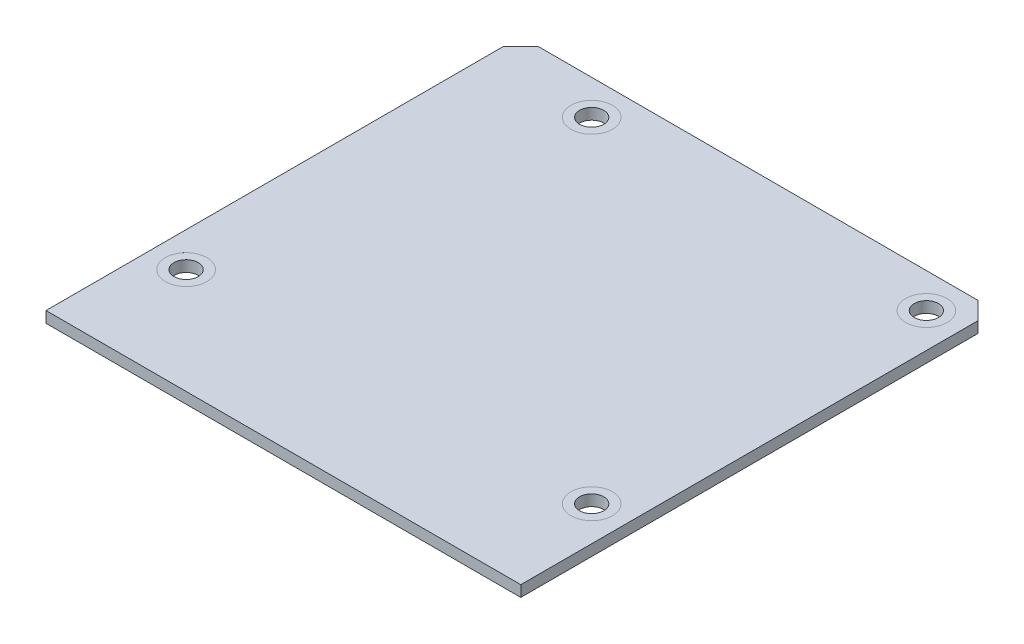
from build123d import *

# Parameters (mm, degrees)
SKETCH1_W           = 68.58
SKETCH1_H           = 68.58
BOSS_EXTRUDE1_DEPTH = 1.6
CHAMFER1_SIZE       = 2.54
CUT_EXTRUDE1_REACH  = 50.52
SKETCH2_R           = 1.75
SKETCH3_R           = 3
CUT_EXTRUDE2_DEPTH  = 0.0001


with BuildPart() as part:
    # Sketch1 → Boss-Extrude1 (new body)
    with BuildSketch(Plane(origin=(0, 0, 0), x_dir=(1, 0, 0), z_dir=(0, 1, 0))):
        Rectangle(SKETCH1_W, SKETCH1_H)
    extrude(amount=BOSS_EXTRUDE1_DEPTH)

    # Chamfer1
    chamfer1_edges = [part.edges().sort_by_distance(p)[0] for p in [
        (-34.29, 0.8, -34.29),
        (34.29, 0.8, -34.29),
    ]]
    chamfer(chamfer1_edges, length=CHAMFER1_SIZE)

    # Sketch2 → Cut-Extrude1 (cut, up to next)
    with BuildSketch(Plane(origin=(0, 1.6, 0), x_dir=(1, 0, 0), z_dir=(0, 1, 0)), mode=Mode.PRIVATE) as cut_extrude1_sk1:
        with Locations(Location((-19.05, 29.29, 0), (0, 0, 270))):
            Circle(SKETCH2_R)
    cut_extrude1_tool1 = extrude(cut_extrude1_sk1.sketch, amount=-CUT_EXTRUDE1_REACH, mode=Mode.PRIVATE) & part.part
    # Sketch2 → Cut-Extrude1 (cut, up to next)
    with BuildSketch(Plane(origin=(0, 1.6, 0), x_dir=(1, 0, 0), z_dir=(0, 1, 0)), mode=Mode.PRIVATE) as cut_extrude1_sk2:
        with Locations(Location((29.29, 29.29, 0), (0, 0, 270))):
            Circle(SKETCH2_R)
    cut_extrude1_tool2 = extrude(cut_extrude1_sk2.sketch, amount=-CUT_EXTRUDE1_REACH, mode=Mode.PRIVATE) & part.part
    # Sketch2 → Cut-Extrude1 (cut, up to next)
    with BuildSketch(Plane(origin=(0, 1.6, 0), x_dir=(1, 0, 0), z_dir=(0, 1, 0)), mode=Mode.PRIVATE) as cut_extrude1_sk3:
        with Locations(Location((29.29, -19.05, 0), (0, 0, 270))):
            Circle(SKETCH2_R)
    cut_extrude1_tool3 = extrude(cut_extrude1_sk3.sketch, amount=-CUT_EXTRUDE1_REACH, mode=Mode.PRIVATE) & part.part
    # Sketch2 → Cut-Extrude1 (cut, up to next)
    with BuildSketch(Plane(origin=(0, 1.6, 0), x_dir=(1, 0, 0), z_dir=(0, 1, 0)), mode=Mode.PRIVATE) as cut_extrude1_sk4:
        with Locations(Location((-29.29, -19.05, 0), (0, 0, 270))):
            Circle(SKETCH2_R)
    cut_extrude1_tool4 = extrude(cut_extrude1_sk4.sketch, amount=-CUT_EXTRUDE1_REACH, mode=Mode.PRIVATE) & part.part
    add(cut_extrude1_tool1.solids().sort_by_distance((-19.05, 1.6, -29.29))[0], mode=Mode.SUBTRACT)
    add(cut_extrude1_tool2.solids().sort_by_distance((29.29, 1.6, -29.29))[0], mode=Mode.SUBTRACT)
    add(cut_extrude1_tool3.solids().sort_by_distance((29.29, 1.6, 19.05))[0], mode=Mode.SUBTRACT)
    add(cut_extrude1_tool4.solids().sort_by_distance((-29.29, 1.6, 19.05))[0], mode=Mode.SUBTRACT)

    # Sketch3 → Cut-Extrude2 (cut)
    with BuildSketch(Plane(origin=(0, 1.6, 0), x_dir=(1, 0, 0), z_dir=(0, 1, 0))):
        with Locations(Location((-19.05, 29.29, 0), (0, 0, 270))):
            Circle(SKETCH3_R)
        with Locations(Location((29.29, 29.29, 0), (0, 0, 270))):
            Circle(SKETCH3_R)
        with Locations(Location((-29.29, -19.05, 0), (0, 0, 270))):
            Circle(SKETCH3_R)
        with Locations(Location((29.29, -19.05, 0), (0, 0, 270))):
            Circle(SKETCH3_R)
    extrude(amount=-CUT_EXTRUDE2_DEPTH, mode=Mode.SUBTRACT)


solid = part.part
